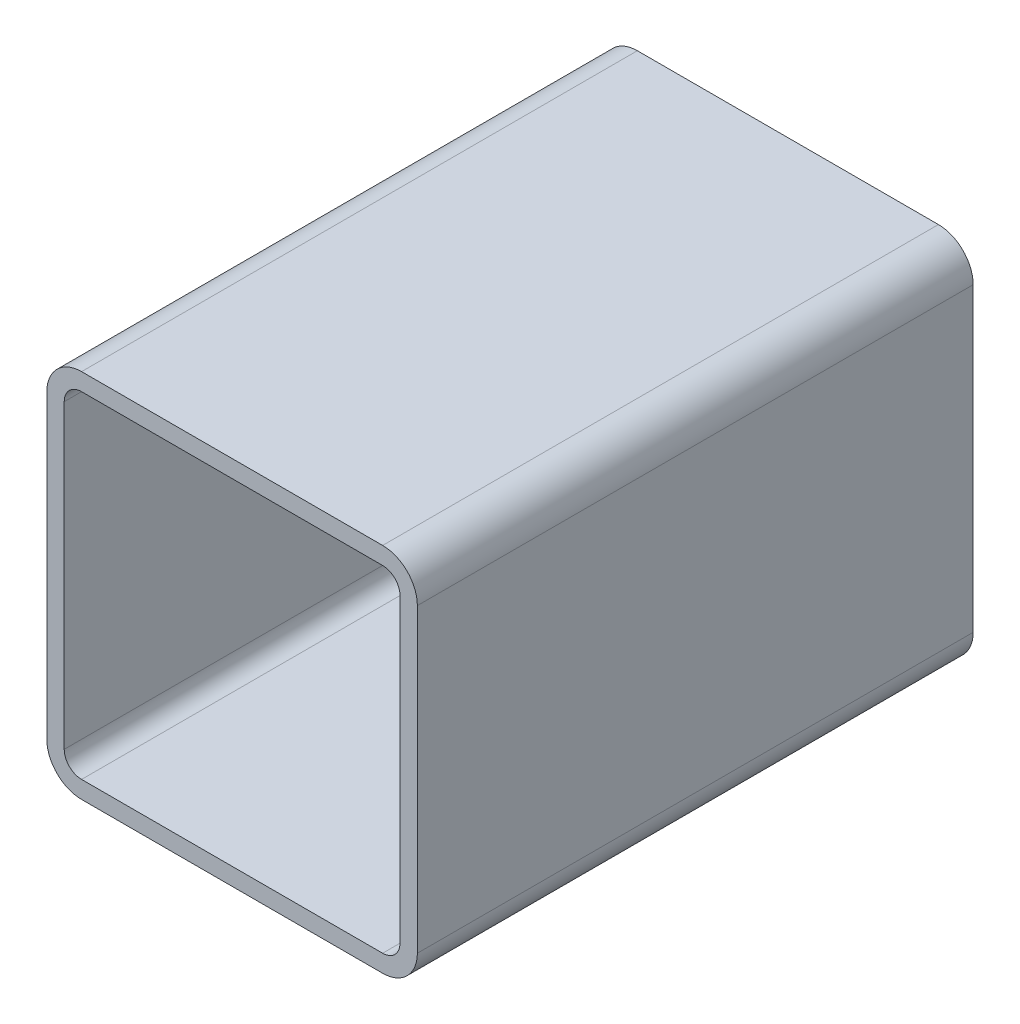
ISO-10303-21;
HEADER;
FILE_DESCRIPTION(('STEP AP214'),'2;1');
FILE_NAME('part.step','',(''),(''),'','','');
FILE_SCHEMA(('AUTOMOTIVE_DESIGN { 1 0 10303 214 1 1 1 1 }'));
ENDSEC;
DATA;
#1=APPLICATION_CONTEXT('core data for automotive mechanical design processes');
#2=APPLICATION_PROTOCOL_DEFINITION('international standard','automotive_design',2000,#1);
#3=PRODUCT_CONTEXT('',#1,'mechanical');
#4=PRODUCT('Part','Part','',(#3));
#5=PRODUCT_RELATED_PRODUCT_CATEGORY('part','',(#4));
#6=PRODUCT_DEFINITION_FORMATION('','',#4);
#7=PRODUCT_DEFINITION_CONTEXT('part definition',#1,'design');
#8=PRODUCT_DEFINITION('design','',#6,#7);
#9=PRODUCT_DEFINITION_SHAPE('','',#8);
#10=(LENGTH_UNIT() NAMED_UNIT(*) SI_UNIT(.MILLI.,.METRE.));
#11=(NAMED_UNIT(*) PLANE_ANGLE_UNIT() SI_UNIT($,.RADIAN.));
#12=(NAMED_UNIT(*) SI_UNIT($,.STERADIAN.) SOLID_ANGLE_UNIT());
#13=UNCERTAINTY_MEASURE_WITH_UNIT(LENGTH_MEASURE(1.E-05),#10,'distance_accuracy_value','');
#14=(GEOMETRIC_REPRESENTATION_CONTEXT(3) GLOBAL_UNCERTAINTY_ASSIGNED_CONTEXT((#13)) GLOBAL_UNIT_ASSIGNED_CONTEXT((#10,
#11,#12)) REPRESENTATION_CONTEXT('',''));
#15=CARTESIAN_POINT('',(0.,0.,0.));
#16=DIRECTION('',(0.,0.,1.));
#17=DIRECTION('',(1.,0.,0.));
#18=AXIS2_PLACEMENT_3D('',#15,#16,#17);
#19=CARTESIAN_POINT('',(20.4409404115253,186.116130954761,304.8));
#20=DIRECTION('',(0.,0.,1.));
#21=DIRECTION('',(1.,0.,0.));
#22=AXIS2_PLACEMENT_3D('',#19,#20,#21);
#23=PLANE('',#22);
#24=CARTESIAN_POINT('',(20.4409404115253,186.116130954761,304.8));
#25=DIRECTION('',(0.,0.,1.));
#26=DIRECTION('',(1.,0.,0.));
#27=AXIS2_PLACEMENT_3D('',#24,#25,#26);
#28=CIRCLE('',#27,19.05);
#29=CARTESIAN_POINT('',(20.4409404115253,205.166130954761,304.8));
#30=VERTEX_POINT('',#29);
#31=CARTESIAN_POINT('',(1.3909404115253,186.116130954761,304.8));
#32=VERTEX_POINT('',#31);
#33=EDGE_CURVE('E211',#30,#32,#28,.T.);
#34=ORIENTED_EDGE('',*,*,#33,.T.);
#35=DIRECTION('',(0.,-1.,0.));
#36=VECTOR('',#35,1.);
#37=CARTESIAN_POINT('',(1.3909404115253,21.0161309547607,304.8));
#38=LINE('',#37,#36);
#39=CARTESIAN_POINT('',(1.3909404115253,21.0161309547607,304.8));
#40=VERTEX_POINT('',#39);
#41=EDGE_CURVE('E214',#32,#40,#38,.T.);
#42=ORIENTED_EDGE('',*,*,#41,.T.);
#43=CARTESIAN_POINT('',(20.4409404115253,21.0161309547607,304.8));
#44=DIRECTION('',(0.,0.,1.));
#45=DIRECTION('',(1.,0.,0.));
#46=AXIS2_PLACEMENT_3D('',#43,#44,#45);
#47=CIRCLE('',#46,19.05);
#48=CARTESIAN_POINT('',(20.4409404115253,1.96613095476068,304.8));
#49=VERTEX_POINT('',#48);
#50=EDGE_CURVE('E217',#40,#49,#47,.T.);
#51=ORIENTED_EDGE('',*,*,#50,.T.);
#52=DIRECTION('',(1.,0.,0.));
#53=VECTOR('',#52,1.);
#54=CARTESIAN_POINT('',(185.540940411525,1.96613095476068,304.8));
#55=LINE('',#54,#53);
#56=CARTESIAN_POINT('',(185.540940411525,1.96613095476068,304.8));
#57=VERTEX_POINT('',#56);
#58=EDGE_CURVE('E219',#49,#57,#55,.T.);
#59=ORIENTED_EDGE('',*,*,#58,.T.);
#60=CARTESIAN_POINT('',(185.540940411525,21.0161309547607,304.8));
#61=DIRECTION('',(0.,0.,1.));
#62=DIRECTION('',(1.,0.,0.));
#63=AXIS2_PLACEMENT_3D('',#60,#61,#62);
#64=CIRCLE('',#63,19.05);
#65=CARTESIAN_POINT('',(204.590940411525,21.0161309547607,304.8));
#66=VERTEX_POINT('',#65);
#67=EDGE_CURVE('E221',#57,#66,#64,.T.);
#68=ORIENTED_EDGE('',*,*,#67,.T.);
#69=DIRECTION('',(0.,1.,0.));
#70=VECTOR('',#69,1.);
#71=CARTESIAN_POINT('',(204.590940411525,186.116130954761,304.8));
#72=LINE('',#71,#70);
#73=CARTESIAN_POINT('',(204.590940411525,186.116130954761,304.8));
#74=VERTEX_POINT('',#73);
#75=EDGE_CURVE('E223',#66,#74,#72,.T.);
#76=ORIENTED_EDGE('',*,*,#75,.T.);
#77=CARTESIAN_POINT('',(185.540940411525,186.116130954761,304.8));
#78=DIRECTION('',(0.,0.,1.));
#79=DIRECTION('',(1.,0.,0.));
#80=AXIS2_PLACEMENT_3D('',#77,#78,#79);
#81=CIRCLE('',#80,19.05);
#82=CARTESIAN_POINT('',(185.540940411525,205.166130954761,304.8));
#83=VERTEX_POINT('',#82);
#84=EDGE_CURVE('E225',#74,#83,#81,.T.);
#85=ORIENTED_EDGE('',*,*,#84,.T.);
#86=DIRECTION('',(-1.,0.,0.));
#87=VECTOR('',#86,1.);
#88=CARTESIAN_POINT('',(20.4409404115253,205.166130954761,304.8));
#89=LINE('',#88,#87);
#90=EDGE_CURVE('E227',#83,#30,#89,.T.);
#91=ORIENTED_EDGE('',*,*,#90,.T.);
#92=EDGE_LOOP('',(#34,#42,#51,#59,#68,#76,#85,#91));
#93=FACE_BOUND('',#92,.T.);
#94=DIRECTION('',(0.,-1.,0.));
#95=VECTOR('',#94,1.);
#96=CARTESIAN_POINT('',(10.9159404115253,21.0161309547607,304.8));
#97=LINE('',#96,#95);
#98=CARTESIAN_POINT('',(10.9159404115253,186.116130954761,304.8));
#99=VERTEX_POINT('',#98);
#100=CARTESIAN_POINT('',(10.9159404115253,21.0161309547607,304.8));
#101=VERTEX_POINT('',#100);
#102=EDGE_CURVE('E154',#99,#101,#97,.T.);
#103=ORIENTED_EDGE('',*,*,#102,.F.);
#104=CARTESIAN_POINT('',(20.4409404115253,186.116130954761,304.8));
#105=DIRECTION('',(0.,0.,1.));
#106=DIRECTION('',(1.,0.,0.));
#107=AXIS2_PLACEMENT_3D('',#104,#105,#106);
#108=CIRCLE('',#107,9.52500000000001);
#109=CARTESIAN_POINT('',(20.4409404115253,195.641130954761,304.8));
#110=VERTEX_POINT('',#109);
#111=EDGE_CURVE('E146',#110,#99,#108,.T.);
#112=ORIENTED_EDGE('',*,*,#111,.F.);
#113=DIRECTION('',(-1.,0.,0.));
#114=VECTOR('',#113,1.);
#115=CARTESIAN_POINT('',(20.4409404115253,195.641130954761,304.8));
#116=LINE('',#115,#114);
#117=CARTESIAN_POINT('',(185.540940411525,195.641130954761,304.8));
#118=VERTEX_POINT('',#117);
#119=EDGE_CURVE('E179',#118,#110,#116,.T.);
#120=ORIENTED_EDGE('',*,*,#119,.F.);
#121=CARTESIAN_POINT('',(185.540940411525,186.116130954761,304.8));
#122=DIRECTION('',(0.,0.,1.));
#123=DIRECTION('',(1.,0.,0.));
#124=AXIS2_PLACEMENT_3D('',#121,#122,#123);
#125=CIRCLE('',#124,9.52500000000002);
#126=CARTESIAN_POINT('',(195.065940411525,186.116130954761,304.8));
#127=VERTEX_POINT('',#126);
#128=EDGE_CURVE('E177',#127,#118,#125,.T.);
#129=ORIENTED_EDGE('',*,*,#128,.F.);
#130=DIRECTION('',(0.,1.,0.));
#131=VECTOR('',#130,1.);
#132=CARTESIAN_POINT('',(195.065940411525,186.116130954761,304.8));
#133=LINE('',#132,#131);
#134=CARTESIAN_POINT('',(195.065940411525,21.0161309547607,304.8));
#135=VERTEX_POINT('',#134);
#136=EDGE_CURVE('E175',#135,#127,#133,.T.);
#137=ORIENTED_EDGE('',*,*,#136,.F.);
#138=CARTESIAN_POINT('',(185.540940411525,21.0161309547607,304.8));
#139=DIRECTION('',(0.,0.,1.));
#140=DIRECTION('',(1.,0.,0.));
#141=AXIS2_PLACEMENT_3D('',#138,#139,#140);
#142=CIRCLE('',#141,9.52500000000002);
#143=CARTESIAN_POINT('',(185.540940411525,11.4911309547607,304.8));
#144=VERTEX_POINT('',#143);
#145=EDGE_CURVE('E173',#144,#135,#142,.T.);
#146=ORIENTED_EDGE('',*,*,#145,.F.);
#147=DIRECTION('',(1.,0.,0.));
#148=VECTOR('',#147,1.);
#149=CARTESIAN_POINT('',(185.540940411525,11.4911309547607,304.8));
#150=LINE('',#149,#148);
#151=CARTESIAN_POINT('',(20.4409404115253,11.4911309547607,304.8));
#152=VERTEX_POINT('',#151);
#153=EDGE_CURVE('E169',#152,#144,#150,.T.);
#154=ORIENTED_EDGE('',*,*,#153,.F.);
#155=CARTESIAN_POINT('',(20.4409404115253,21.0161309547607,304.8));
#156=DIRECTION('',(0.,0.,1.));
#157=DIRECTION('',(1.,0.,0.));
#158=AXIS2_PLACEMENT_3D('',#155,#156,#157);
#159=CIRCLE('',#158,9.525);
#160=EDGE_CURVE('E167',#101,#152,#159,.T.);
#161=ORIENTED_EDGE('',*,*,#160,.F.);
#162=EDGE_LOOP('',(#103,#112,#120,#129,#137,#146,#154,#161));
#163=FACE_BOUND('',#162,.T.);
#164=ADVANCED_FACE('F33',(#93,#163),#23,.T.);
#165=CARTESIAN_POINT('',(20.4409404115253,186.116130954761,0.));
#166=DIRECTION('',(0.,0.,1.));
#167=DIRECTION('',(1.,0.,0.));
#168=AXIS2_PLACEMENT_3D('',#165,#166,#167);
#169=PLANE('',#168);
#170=CARTESIAN_POINT('',(20.4409404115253,186.116130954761,0.));
#171=DIRECTION('',(0.,0.,1.));
#172=DIRECTION('',(1.,0.,0.));
#173=AXIS2_PLACEMENT_3D('',#170,#171,#172);
#174=CIRCLE('',#173,19.05);
#175=CARTESIAN_POINT('',(20.4409404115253,205.166130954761,0.));
#176=VERTEX_POINT('',#175);
#177=CARTESIAN_POINT('',(1.3909404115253,186.116130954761,0.));
#178=VERTEX_POINT('',#177);
#179=EDGE_CURVE('E162',#176,#178,#174,.T.);
#180=ORIENTED_EDGE('',*,*,#179,.F.);
#181=DIRECTION('',(-1.,0.,0.));
#182=VECTOR('',#181,1.);
#183=CARTESIAN_POINT('',(20.4409404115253,205.166130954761,0.));
#184=LINE('',#183,#182);
#185=CARTESIAN_POINT('',(185.540940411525,205.166130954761,0.));
#186=VERTEX_POINT('',#185);
#187=EDGE_CURVE('E215',#186,#176,#184,.T.);
#188=ORIENTED_EDGE('',*,*,#187,.F.);
#189=CARTESIAN_POINT('',(185.540940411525,186.116130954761,0.));
#190=DIRECTION('',(0.,0.,1.));
#191=DIRECTION('',(1.,0.,0.));
#192=AXIS2_PLACEMENT_3D('',#189,#190,#191);
#193=CIRCLE('',#192,19.05);
#194=CARTESIAN_POINT('',(204.590940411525,186.116130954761,0.));
#195=VERTEX_POINT('',#194);
#196=EDGE_CURVE('E242',#195,#186,#193,.T.);
#197=ORIENTED_EDGE('',*,*,#196,.F.);
#198=DIRECTION('',(0.,1.,0.));
#199=VECTOR('',#198,1.);
#200=CARTESIAN_POINT('',(204.590940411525,186.116130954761,0.));
#201=LINE('',#200,#199);
#202=CARTESIAN_POINT('',(204.590940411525,21.0161309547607,0.));
#203=VERTEX_POINT('',#202);
#204=EDGE_CURVE('E240',#203,#195,#201,.T.);
#205=ORIENTED_EDGE('',*,*,#204,.F.);
#206=CARTESIAN_POINT('',(185.540940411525,21.0161309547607,0.));
#207=DIRECTION('',(0.,0.,1.));
#208=DIRECTION('',(1.,0.,0.));
#209=AXIS2_PLACEMENT_3D('',#206,#207,#208);
#210=CIRCLE('',#209,19.05);
#211=CARTESIAN_POINT('',(185.540940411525,1.96613095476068,0.));
#212=VERTEX_POINT('',#211);
#213=EDGE_CURVE('E238',#212,#203,#210,.T.);
#214=ORIENTED_EDGE('',*,*,#213,.F.);
#215=DIRECTION('',(1.,0.,0.));
#216=VECTOR('',#215,1.);
#217=CARTESIAN_POINT('',(185.540940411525,1.96613095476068,0.));
#218=LINE('',#217,#216);
#219=CARTESIAN_POINT('',(20.4409404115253,1.96613095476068,0.));
#220=VERTEX_POINT('',#219);
#221=EDGE_CURVE('E236',#220,#212,#218,.T.);
#222=ORIENTED_EDGE('',*,*,#221,.F.);
#223=CARTESIAN_POINT('',(20.4409404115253,21.0161309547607,0.));
#224=DIRECTION('',(0.,0.,1.));
#225=DIRECTION('',(1.,0.,0.));
#226=AXIS2_PLACEMENT_3D('',#223,#224,#225);
#227=CIRCLE('',#226,19.05);
#228=CARTESIAN_POINT('',(1.3909404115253,21.0161309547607,0.));
#229=VERTEX_POINT('',#228);
#230=EDGE_CURVE('E234',#229,#220,#227,.T.);
#231=ORIENTED_EDGE('',*,*,#230,.F.);
#232=DIRECTION('',(0.,-1.,0.));
#233=VECTOR('',#232,1.);
#234=CARTESIAN_POINT('',(1.3909404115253,21.0161309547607,0.));
#235=LINE('',#234,#233);
#236=EDGE_CURVE('E232',#178,#229,#235,.T.);
#237=ORIENTED_EDGE('',*,*,#236,.F.);
#238=EDGE_LOOP('',(#180,#188,#197,#205,#214,#222,#231,#237));
#239=FACE_BOUND('',#238,.T.);
#240=CARTESIAN_POINT('',(20.4409404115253,186.116130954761,0.));
#241=DIRECTION('',(0.,0.,1.));
#242=DIRECTION('',(1.,0.,0.));
#243=AXIS2_PLACEMENT_3D('',#240,#241,#242);
#244=CIRCLE('',#243,9.52500000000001);
#245=CARTESIAN_POINT('',(20.4409404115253,195.641130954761,0.));
#246=VERTEX_POINT('',#245);
#247=CARTESIAN_POINT('',(10.9159404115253,186.116130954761,0.));
#248=VERTEX_POINT('',#247);
#249=EDGE_CURVE('E56',#246,#248,#244,.T.);
#250=ORIENTED_EDGE('',*,*,#249,.T.);
#251=DIRECTION('',(0.,-1.,0.));
#252=VECTOR('',#251,1.);
#253=CARTESIAN_POINT('',(10.9159404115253,21.0161309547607,0.));
#254=LINE('',#253,#252);
#255=CARTESIAN_POINT('',(10.9159404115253,21.0161309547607,0.));
#256=VERTEX_POINT('',#255);
#257=EDGE_CURVE('E161',#248,#256,#254,.T.);
#258=ORIENTED_EDGE('',*,*,#257,.T.);
#259=CARTESIAN_POINT('',(20.4409404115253,21.0161309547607,0.));
#260=DIRECTION('',(0.,0.,1.));
#261=DIRECTION('',(1.,0.,0.));
#262=AXIS2_PLACEMENT_3D('',#259,#260,#261);
#263=CIRCLE('',#262,9.525);
#264=CARTESIAN_POINT('',(20.4409404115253,11.4911309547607,0.));
#265=VERTEX_POINT('',#264);
#266=EDGE_CURVE('E183',#256,#265,#263,.T.);
#267=ORIENTED_EDGE('',*,*,#266,.T.);
#268=DIRECTION('',(1.,0.,0.));
#269=VECTOR('',#268,1.);
#270=CARTESIAN_POINT('',(185.540940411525,11.4911309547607,0.));
#271=LINE('',#270,#269);
#272=CARTESIAN_POINT('',(185.540940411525,11.4911309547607,0.));
#273=VERTEX_POINT('',#272);
#274=EDGE_CURVE('E186',#265,#273,#271,.T.);
#275=ORIENTED_EDGE('',*,*,#274,.T.);
#276=CARTESIAN_POINT('',(185.540940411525,21.0161309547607,0.));
#277=DIRECTION('',(0.,0.,1.));
#278=DIRECTION('',(1.,0.,0.));
#279=AXIS2_PLACEMENT_3D('',#276,#277,#278);
#280=CIRCLE('',#279,9.52500000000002);
#281=CARTESIAN_POINT('',(195.065940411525,21.0161309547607,0.));
#282=VERTEX_POINT('',#281);
#283=EDGE_CURVE('E189',#273,#282,#280,.T.);
#284=ORIENTED_EDGE('',*,*,#283,.T.);
#285=DIRECTION('',(0.,1.,0.));
#286=VECTOR('',#285,1.);
#287=CARTESIAN_POINT('',(195.065940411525,186.116130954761,0.));
#288=LINE('',#287,#286);
#289=CARTESIAN_POINT('',(195.065940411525,186.116130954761,0.));
#290=VERTEX_POINT('',#289);
#291=EDGE_CURVE('E192',#282,#290,#288,.T.);
#292=ORIENTED_EDGE('',*,*,#291,.T.);
#293=CARTESIAN_POINT('',(185.540940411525,186.116130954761,0.));
#294=DIRECTION('',(0.,0.,1.));
#295=DIRECTION('',(1.,0.,0.));
#296=AXIS2_PLACEMENT_3D('',#293,#294,#295);
#297=CIRCLE('',#296,9.52500000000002);
#298=CARTESIAN_POINT('',(185.540940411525,195.641130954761,0.));
#299=VERTEX_POINT('',#298);
#300=EDGE_CURVE('E195',#290,#299,#297,.T.);
#301=ORIENTED_EDGE('',*,*,#300,.T.);
#302=DIRECTION('',(-1.,0.,0.));
#303=VECTOR('',#302,1.);
#304=CARTESIAN_POINT('',(20.4409404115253,195.641130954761,0.));
#305=LINE('',#304,#303);
#306=EDGE_CURVE('E155',#299,#246,#305,.T.);
#307=ORIENTED_EDGE('',*,*,#306,.T.);
#308=EDGE_LOOP('',(#250,#258,#267,#275,#284,#292,#301,#307));
#309=FACE_BOUND('',#308,.T.);
#310=ADVANCED_FACE('F272',(#239,#309),#169,.F.);
#311=CARTESIAN_POINT('',(20.4409404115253,186.116130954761,304.8));
#312=DIRECTION('',(0.,0.,-1.));
#313=DIRECTION('',(-1.,0.,0.));
#314=AXIS2_PLACEMENT_3D('',#311,#312,#313);
#315=CYLINDRICAL_SURFACE('',#314,19.05);
#316=ORIENTED_EDGE('',*,*,#179,.T.);
#317=DIRECTION('',(0.,0.,-1.));
#318=VECTOR('',#317,1.);
#319=CARTESIAN_POINT('',(1.3909404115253,186.116130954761,304.8));
#320=LINE('',#319,#318);
#321=EDGE_CURVE('E11',#32,#178,#320,.T.);
#322=ORIENTED_EDGE('',*,*,#321,.F.);
#323=ORIENTED_EDGE('',*,*,#33,.F.);
#324=DIRECTION('',(0.,0.,-1.));
#325=VECTOR('',#324,1.);
#326=CARTESIAN_POINT('',(20.4409404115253,205.166130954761,304.8));
#327=LINE('',#326,#325);
#328=EDGE_CURVE('E229',#30,#176,#327,.T.);
#329=ORIENTED_EDGE('',*,*,#328,.T.);
#330=EDGE_LOOP('',(#316,#322,#323,#329));
#331=FACE_BOUND('',#330,.T.);
#332=ADVANCED_FACE('F35',(#331),#315,.T.);
#333=CARTESIAN_POINT('',(1.3909404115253,21.0161309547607,304.8));
#334=DIRECTION('',(1.,0.,0.));
#335=DIRECTION('',(0.,0.,-1.));
#336=AXIS2_PLACEMENT_3D('',#333,#334,#335);
#337=PLANE('',#336);
#338=ORIENTED_EDGE('',*,*,#236,.T.);
#339=DIRECTION('',(0.,0.,-1.));
#340=VECTOR('',#339,1.);
#341=CARTESIAN_POINT('',(1.3909404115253,21.0161309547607,304.8));
#342=LINE('',#341,#340);
#343=EDGE_CURVE('E41',#40,#229,#342,.T.);
#344=ORIENTED_EDGE('',*,*,#343,.F.);
#345=ORIENTED_EDGE('',*,*,#41,.F.);
#346=ORIENTED_EDGE('',*,*,#321,.T.);
#347=EDGE_LOOP('',(#338,#344,#345,#346));
#348=FACE_BOUND('',#347,.T.);
#349=ADVANCED_FACE('F289',(#348),#337,.F.);
#350=CARTESIAN_POINT('',(20.4409404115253,21.0161309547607,304.8));
#351=DIRECTION('',(0.,0.,-1.));
#352=DIRECTION('',(-1.,0.,0.));
#353=AXIS2_PLACEMENT_3D('',#350,#351,#352);
#354=CYLINDRICAL_SURFACE('',#353,19.05);
#355=ORIENTED_EDGE('',*,*,#230,.T.);
#356=DIRECTION('',(0.,0.,-1.));
#357=VECTOR('',#356,1.);
#358=CARTESIAN_POINT('',(20.4409404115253,1.96613095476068,304.8));
#359=LINE('',#358,#357);
#360=EDGE_CURVE('E259',#49,#220,#359,.T.);
#361=ORIENTED_EDGE('',*,*,#360,.F.);
#362=ORIENTED_EDGE('',*,*,#50,.F.);
#363=ORIENTED_EDGE('',*,*,#343,.T.);
#364=EDGE_LOOP('',(#355,#361,#362,#363));
#365=FACE_BOUND('',#364,.T.);
#366=ADVANCED_FACE('F266',(#365),#354,.T.);
#367=CARTESIAN_POINT('',(185.540940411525,1.96613095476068,304.8));
#368=DIRECTION('',(0.,1.,0.));
#369=DIRECTION('',(0.,0.,1.));
#370=AXIS2_PLACEMENT_3D('',#367,#368,#369);
#371=PLANE('',#370);
#372=ORIENTED_EDGE('',*,*,#221,.T.);
#373=DIRECTION('',(0.,0.,-1.));
#374=VECTOR('',#373,1.);
#375=CARTESIAN_POINT('',(185.540940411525,1.96613095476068,304.8));
#376=LINE('',#375,#374);
#377=EDGE_CURVE('E256',#57,#212,#376,.T.);
#378=ORIENTED_EDGE('',*,*,#377,.F.);
#379=ORIENTED_EDGE('',*,*,#58,.F.);
#380=ORIENTED_EDGE('',*,*,#360,.T.);
#381=EDGE_LOOP('',(#372,#378,#379,#380));
#382=FACE_BOUND('',#381,.T.);
#383=ADVANCED_FACE('F278',(#382),#371,.F.);
#384=CARTESIAN_POINT('',(185.540940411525,21.0161309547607,304.8));
#385=DIRECTION('',(0.,0.,-1.));
#386=DIRECTION('',(-1.,0.,0.));
#387=AXIS2_PLACEMENT_3D('',#384,#385,#386);
#388=CYLINDRICAL_SURFACE('',#387,19.05);
#389=ORIENTED_EDGE('',*,*,#213,.T.);
#390=DIRECTION('',(0.,0.,-1.));
#391=VECTOR('',#390,1.);
#392=CARTESIAN_POINT('',(204.590940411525,21.0161309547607,304.8));
#393=LINE('',#392,#391);
#394=EDGE_CURVE('E253',#66,#203,#393,.T.);
#395=ORIENTED_EDGE('',*,*,#394,.F.);
#396=ORIENTED_EDGE('',*,*,#67,.F.);
#397=ORIENTED_EDGE('',*,*,#377,.T.);
#398=EDGE_LOOP('',(#389,#395,#396,#397));
#399=FACE_BOUND('',#398,.T.);
#400=ADVANCED_FACE('F282',(#399),#388,.T.);
#401=CARTESIAN_POINT('',(204.590940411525,186.116130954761,304.8));
#402=DIRECTION('',(-1.,0.,0.));
#403=DIRECTION('',(0.,0.,1.));
#404=AXIS2_PLACEMENT_3D('',#401,#402,#403);
#405=PLANE('',#404);
#406=ORIENTED_EDGE('',*,*,#204,.T.);
#407=DIRECTION('',(0.,0.,-1.));
#408=VECTOR('',#407,1.);
#409=CARTESIAN_POINT('',(204.590940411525,186.116130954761,304.8));
#410=LINE('',#409,#408);
#411=EDGE_CURVE('E250',#74,#195,#410,.T.);
#412=ORIENTED_EDGE('',*,*,#411,.F.);
#413=ORIENTED_EDGE('',*,*,#75,.F.);
#414=ORIENTED_EDGE('',*,*,#394,.T.);
#415=EDGE_LOOP('',(#406,#412,#413,#414));
#416=FACE_BOUND('',#415,.T.);
#417=ADVANCED_FACE('F302',(#416),#405,.F.);
#418=CARTESIAN_POINT('',(185.540940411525,186.116130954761,304.8));
#419=DIRECTION('',(0.,0.,-1.));
#420=DIRECTION('',(-1.,0.,0.));
#421=AXIS2_PLACEMENT_3D('',#418,#419,#420);
#422=CYLINDRICAL_SURFACE('',#421,19.05);
#423=ORIENTED_EDGE('',*,*,#196,.T.);
#424=DIRECTION('',(0.,0.,-1.));
#425=VECTOR('',#424,1.);
#426=CARTESIAN_POINT('',(185.540940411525,205.166130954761,304.8));
#427=LINE('',#426,#425);
#428=EDGE_CURVE('E247',#83,#186,#427,.T.);
#429=ORIENTED_EDGE('',*,*,#428,.F.);
#430=ORIENTED_EDGE('',*,*,#84,.F.);
#431=ORIENTED_EDGE('',*,*,#411,.T.);
#432=EDGE_LOOP('',(#423,#429,#430,#431));
#433=FACE_BOUND('',#432,.T.);
#434=ADVANCED_FACE('F300',(#433),#422,.T.);
#435=CARTESIAN_POINT('',(20.4409404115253,205.166130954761,304.8));
#436=DIRECTION('',(0.,-1.,0.));
#437=DIRECTION('',(0.,0.,-1.));
#438=AXIS2_PLACEMENT_3D('',#435,#436,#437);
#439=PLANE('',#438);
#440=ORIENTED_EDGE('',*,*,#187,.T.);
#441=ORIENTED_EDGE('',*,*,#328,.F.);
#442=ORIENTED_EDGE('',*,*,#90,.F.);
#443=ORIENTED_EDGE('',*,*,#428,.T.);
#444=EDGE_LOOP('',(#440,#441,#442,#443));
#445=FACE_BOUND('',#444,.T.);
#446=ADVANCED_FACE('F295',(#445),#439,.F.);
#447=CARTESIAN_POINT('',(20.4409404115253,186.116130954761,304.8));
#448=DIRECTION('',(0.,0.,-1.));
#449=DIRECTION('',(-1.,0.,0.));
#450=AXIS2_PLACEMENT_3D('',#447,#448,#449);
#451=CYLINDRICAL_SURFACE('',#450,9.52500000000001);
#452=ORIENTED_EDGE('',*,*,#249,.F.);
#453=DIRECTION('',(0.,0.,-1.));
#454=VECTOR('',#453,1.);
#455=CARTESIAN_POINT('',(20.4409404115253,195.641130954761,304.8));
#456=LINE('',#455,#454);
#457=EDGE_CURVE('E150',#110,#246,#456,.T.);
#458=ORIENTED_EDGE('',*,*,#457,.F.);
#459=ORIENTED_EDGE('',*,*,#111,.T.);
#460=DIRECTION('',(0.,0.,-1.));
#461=VECTOR('',#460,1.);
#462=CARTESIAN_POINT('',(10.9159404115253,186.116130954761,304.8));
#463=LINE('',#462,#461);
#464=EDGE_CURVE('E149',#99,#248,#463,.T.);
#465=ORIENTED_EDGE('',*,*,#464,.T.);
#466=EDGE_LOOP('',(#452,#458,#459,#465));
#467=FACE_BOUND('',#466,.T.);
#468=ADVANCED_FACE('F148',(#467),#451,.F.);
#469=CARTESIAN_POINT('',(10.9159404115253,21.0161309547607,304.8));
#470=DIRECTION('',(1.,0.,0.));
#471=DIRECTION('',(0.,0.,-1.));
#472=AXIS2_PLACEMENT_3D('',#469,#470,#471);
#473=PLANE('',#472);
#474=ORIENTED_EDGE('',*,*,#257,.F.);
#475=ORIENTED_EDGE('',*,*,#464,.F.);
#476=ORIENTED_EDGE('',*,*,#102,.T.);
#477=DIRECTION('',(0.,0.,-1.));
#478=VECTOR('',#477,1.);
#479=CARTESIAN_POINT('',(10.9159404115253,21.0161309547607,304.8));
#480=LINE('',#479,#478);
#481=EDGE_CURVE('E163',#101,#256,#480,.T.);
#482=ORIENTED_EDGE('',*,*,#481,.T.);
#483=EDGE_LOOP('',(#474,#475,#476,#482));
#484=FACE_BOUND('',#483,.T.);
#485=ADVANCED_FACE('F158',(#484),#473,.T.);
#486=CARTESIAN_POINT('',(20.4409404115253,21.0161309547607,304.8));
#487=DIRECTION('',(0.,0.,-1.));
#488=DIRECTION('',(-1.,0.,0.));
#489=AXIS2_PLACEMENT_3D('',#486,#487,#488);
#490=CYLINDRICAL_SURFACE('',#489,9.525);
#491=ORIENTED_EDGE('',*,*,#266,.F.);
#492=ORIENTED_EDGE('',*,*,#481,.F.);
#493=ORIENTED_EDGE('',*,*,#160,.T.);
#494=DIRECTION('',(0.,0.,-1.));
#495=VECTOR('',#494,1.);
#496=CARTESIAN_POINT('',(20.4409404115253,11.4911309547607,304.8));
#497=LINE('',#496,#495);
#498=EDGE_CURVE('E208',#152,#265,#497,.T.);
#499=ORIENTED_EDGE('',*,*,#498,.T.);
#500=EDGE_LOOP('',(#491,#492,#493,#499));
#501=FACE_BOUND('',#500,.T.);
#502=ADVANCED_FACE('F327',(#501),#490,.F.);
#503=CARTESIAN_POINT('',(185.540940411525,11.4911309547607,304.8));
#504=DIRECTION('',(0.,1.,0.));
#505=DIRECTION('',(0.,0.,1.));
#506=AXIS2_PLACEMENT_3D('',#503,#504,#505);
#507=PLANE('',#506);
#508=ORIENTED_EDGE('',*,*,#274,.F.);
#509=ORIENTED_EDGE('',*,*,#498,.F.);
#510=ORIENTED_EDGE('',*,*,#153,.T.);
#511=DIRECTION('',(0.,0.,-1.));
#512=VECTOR('',#511,1.);
#513=CARTESIAN_POINT('',(185.540940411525,11.4911309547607,304.8));
#514=LINE('',#513,#512);
#515=EDGE_CURVE('E206',#144,#273,#514,.T.);
#516=ORIENTED_EDGE('',*,*,#515,.T.);
#517=EDGE_LOOP('',(#508,#509,#510,#516));
#518=FACE_BOUND('',#517,.T.);
#519=ADVANCED_FACE('F331',(#518),#507,.T.);
#520=CARTESIAN_POINT('',(185.540940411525,21.0161309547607,304.8));
#521=DIRECTION('',(0.,0.,-1.));
#522=DIRECTION('',(-1.,0.,0.));
#523=AXIS2_PLACEMENT_3D('',#520,#521,#522);
#524=CYLINDRICAL_SURFACE('',#523,9.52500000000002);
#525=ORIENTED_EDGE('',*,*,#283,.F.);
#526=ORIENTED_EDGE('',*,*,#515,.F.);
#527=ORIENTED_EDGE('',*,*,#145,.T.);
#528=DIRECTION('',(0.,0.,-1.));
#529=VECTOR('',#528,1.);
#530=CARTESIAN_POINT('',(195.065940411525,21.0161309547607,304.8));
#531=LINE('',#530,#529);
#532=EDGE_CURVE('E204',#135,#282,#531,.T.);
#533=ORIENTED_EDGE('',*,*,#532,.T.);
#534=EDGE_LOOP('',(#525,#526,#527,#533));
#535=FACE_BOUND('',#534,.T.);
#536=ADVANCED_FACE('F337',(#535),#524,.F.);
#537=CARTESIAN_POINT('',(195.065940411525,186.116130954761,304.8));
#538=DIRECTION('',(-1.,0.,0.));
#539=DIRECTION('',(0.,0.,1.));
#540=AXIS2_PLACEMENT_3D('',#537,#538,#539);
#541=PLANE('',#540);
#542=ORIENTED_EDGE('',*,*,#291,.F.);
#543=ORIENTED_EDGE('',*,*,#532,.F.);
#544=ORIENTED_EDGE('',*,*,#136,.T.);
#545=DIRECTION('',(0.,0.,-1.));
#546=VECTOR('',#545,1.);
#547=CARTESIAN_POINT('',(195.065940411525,186.116130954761,304.8));
#548=LINE('',#547,#546);
#549=EDGE_CURVE('E202',#127,#290,#548,.T.);
#550=ORIENTED_EDGE('',*,*,#549,.T.);
#551=EDGE_LOOP('',(#542,#543,#544,#550));
#552=FACE_BOUND('',#551,.T.);
#553=ADVANCED_FACE('F341',(#552),#541,.T.);
#554=CARTESIAN_POINT('',(185.540940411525,186.116130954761,304.8));
#555=DIRECTION('',(0.,0.,-1.));
#556=DIRECTION('',(-1.,0.,0.));
#557=AXIS2_PLACEMENT_3D('',#554,#555,#556);
#558=CYLINDRICAL_SURFACE('',#557,9.52500000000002);
#559=ORIENTED_EDGE('',*,*,#300,.F.);
#560=ORIENTED_EDGE('',*,*,#549,.F.);
#561=ORIENTED_EDGE('',*,*,#128,.T.);
#562=DIRECTION('',(0.,0.,-1.));
#563=VECTOR('',#562,1.);
#564=CARTESIAN_POINT('',(185.540940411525,195.641130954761,304.8));
#565=LINE('',#564,#563);
#566=EDGE_CURVE('E48',#118,#299,#565,.T.);
#567=ORIENTED_EDGE('',*,*,#566,.T.);
#568=EDGE_LOOP('',(#559,#560,#561,#567));
#569=FACE_BOUND('',#568,.T.);
#570=ADVANCED_FACE('F345',(#569),#558,.F.);
#571=CARTESIAN_POINT('',(20.4409404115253,195.641130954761,304.8));
#572=DIRECTION('',(0.,-1.,0.));
#573=DIRECTION('',(0.,0.,-1.));
#574=AXIS2_PLACEMENT_3D('',#571,#572,#573);
#575=PLANE('',#574);
#576=ORIENTED_EDGE('',*,*,#306,.F.);
#577=ORIENTED_EDGE('',*,*,#566,.F.);
#578=ORIENTED_EDGE('',*,*,#119,.T.);
#579=ORIENTED_EDGE('',*,*,#457,.T.);
#580=EDGE_LOOP('',(#576,#577,#578,#579));
#581=FACE_BOUND('',#580,.T.);
#582=ADVANCED_FACE('F349',(#581),#575,.T.);
#583=CLOSED_SHELL('',(#164,#310,#332,#349,#366,#383,#400,#417,#434,#446,#468,#485,#502,#519,
#536,#553,#570,#582));
#584=MANIFOLD_SOLID_BREP('B2',#583);
#585=ADVANCED_BREP_SHAPE_REPRESENTATION('',(#18,#584),#14);
#586=SHAPE_DEFINITION_REPRESENTATION(#9,#585);
ENDSEC;
END-ISO-10303-21;
